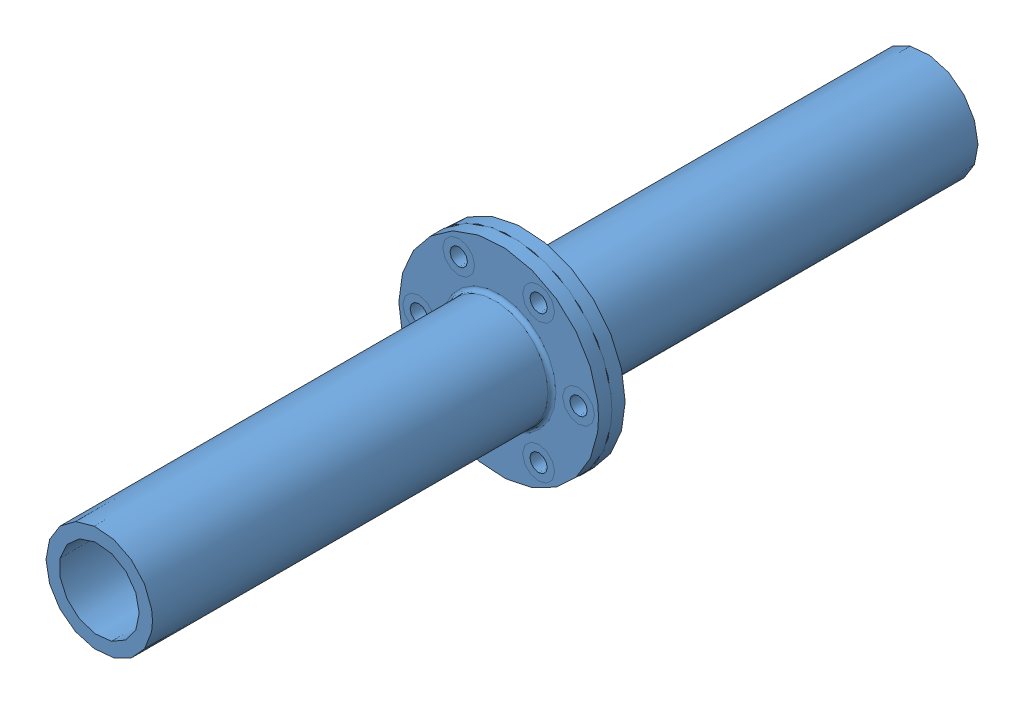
SolidWorks assembly flange.SLDASM, configuration Default (file format 3100). Lengths in mm.
Overall size (150 150 620).
2 component instances, 1 part files, 3 mates.
Components (placement in the parent):
- flange-1: flange.SLDPRT [Default] at origin size (150 150 310)
- flange-2: flange.SLDPRT [Default] x (-1 0 0) z (0 0 -1) size (150 150 310)
Mates (geometry in assembly coordinates):
- Concentric1: concentric anti-aligned: cylinder of flange-1; unknown of flange-2
- Coincident1: coincident anti-aligned: plane of flange-1 through (0 0 0) normal (0 0 -1); unknown of flange-2
- Coincident2: coincident aligned: unknown of flange-1; unknown of flange-2
